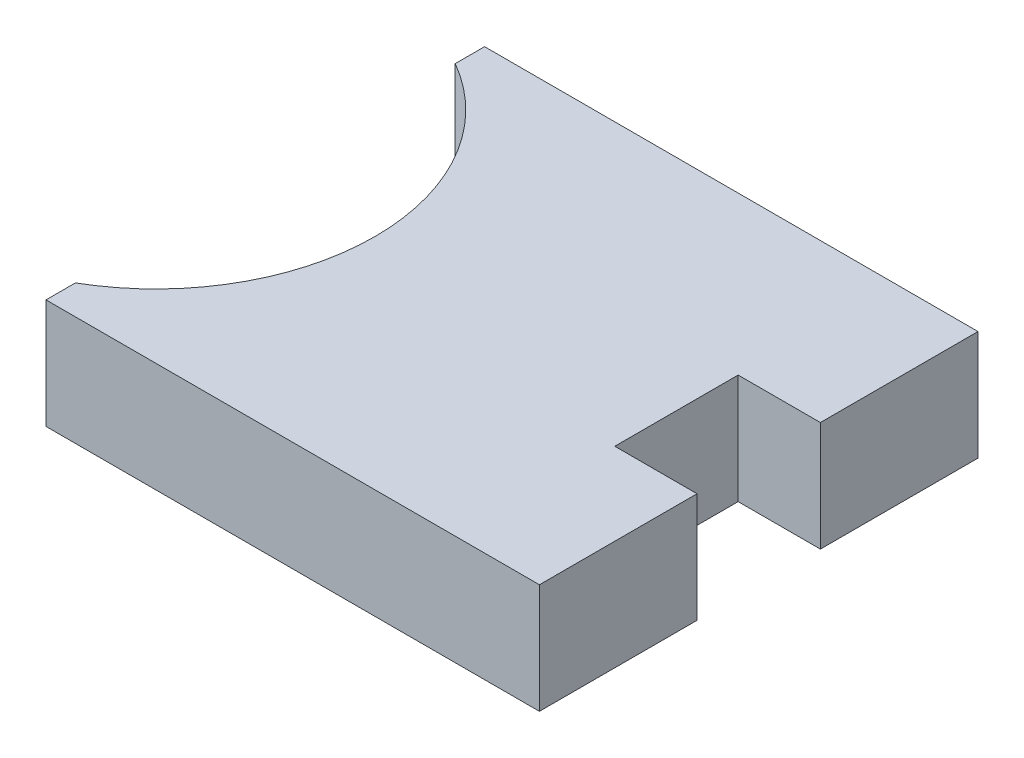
ISO-10303-21;
HEADER;
FILE_DESCRIPTION(('STEP AP214'),'2;1');
FILE_NAME('part.step','',(''),(''),'','','');
FILE_SCHEMA(('AUTOMOTIVE_DESIGN { 1 0 10303 214 1 1 1 1 }'));
ENDSEC;
DATA;
#1=APPLICATION_CONTEXT('core data for automotive mechanical design processes');
#2=APPLICATION_PROTOCOL_DEFINITION('international standard','automotive_design',2000,#1);
#3=PRODUCT_CONTEXT('',#1,'mechanical');
#4=PRODUCT('Part','Part','',(#3));
#5=PRODUCT_RELATED_PRODUCT_CATEGORY('part','',(#4));
#6=PRODUCT_DEFINITION_FORMATION('','',#4);
#7=PRODUCT_DEFINITION_CONTEXT('part definition',#1,'design');
#8=PRODUCT_DEFINITION('design','',#6,#7);
#9=PRODUCT_DEFINITION_SHAPE('','',#8);
#10=(LENGTH_UNIT() NAMED_UNIT(*) SI_UNIT(.MILLI.,.METRE.));
#11=(NAMED_UNIT(*) PLANE_ANGLE_UNIT() SI_UNIT($,.RADIAN.));
#12=(NAMED_UNIT(*) SI_UNIT($,.STERADIAN.) SOLID_ANGLE_UNIT());
#13=UNCERTAINTY_MEASURE_WITH_UNIT(LENGTH_MEASURE(1.E-05),#10,'distance_accuracy_value','');
#14=(GEOMETRIC_REPRESENTATION_CONTEXT(3) GLOBAL_UNCERTAINTY_ASSIGNED_CONTEXT((#13)) GLOBAL_UNIT_ASSIGNED_CONTEXT((#10,
#11,#12)) REPRESENTATION_CONTEXT('',''));
#15=CARTESIAN_POINT('',(0.,0.,0.));
#16=DIRECTION('',(0.,0.,1.));
#17=DIRECTION('',(1.,0.,0.));
#18=AXIS2_PLACEMENT_3D('',#15,#16,#17);
#19=CARTESIAN_POINT('',(46.5,6.75,-13.1782032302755));
#20=DIRECTION('',(-1.,0.,0.));
#21=DIRECTION('',(0.,0.,-1.));
#22=AXIS2_PLACEMENT_3D('',#19,#20,#21);
#23=PLANE('',#22);
#24=DIRECTION('',(0.,1.,0.));
#25=VECTOR('',#24,1.);
#26=CARTESIAN_POINT('',(46.5,4.74999999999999,-14.25));
#27=LINE('',#26,#25);
#28=CARTESIAN_POINT('',(46.5,2.74999999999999,-14.2500000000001));
#29=VERTEX_POINT('',#28);
#30=CARTESIAN_POINT('',(46.5,6.74999999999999,-14.2500000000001));
#31=VERTEX_POINT('',#30);
#32=EDGE_CURVE('E102',#29,#31,#27,.T.);
#33=ORIENTED_EDGE('',*,*,#32,.F.);
#34=DIRECTION('',(0.,0.,-1.));
#35=VECTOR('',#34,1.);
#36=CARTESIAN_POINT('',(46.5,2.75,-6.25000000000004));
#37=LINE('',#36,#35);
#38=CARTESIAN_POINT('',(46.5,2.74999999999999,-13.1782032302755));
#39=VERTEX_POINT('',#38);
#40=EDGE_CURVE('E97',#39,#29,#37,.T.);
#41=ORIENTED_EDGE('',*,*,#40,.F.);
#42=DIRECTION('',(0.,1.,0.));
#43=VECTOR('',#42,1.);
#44=CARTESIAN_POINT('',(46.5,4.75,-13.1782032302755));
#45=LINE('',#44,#43);
#46=CARTESIAN_POINT('',(46.5,6.74999999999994,-13.1782032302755));
#47=VERTEX_POINT('',#46);
#48=EDGE_CURVE('E99',#39,#47,#45,.T.);
#49=ORIENTED_EDGE('',*,*,#48,.T.);
#50=DIRECTION('',(0.,0.,-1.));
#51=VECTOR('',#50,1.);
#52=CARTESIAN_POINT('',(46.5,6.75,-13.7141016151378));
#53=LINE('',#52,#51);
#54=EDGE_CURVE('E134',#47,#31,#53,.T.);
#55=ORIENTED_EDGE('',*,*,#54,.T.);
#56=EDGE_LOOP('',(#33,#41,#49,#55));
#57=FACE_BOUND('',#56,.T.);
#58=ADVANCED_FACE('F16',(#57),#23,.T.);
#59=CARTESIAN_POINT('',(46.5,6.75000000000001,1.74999999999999));
#60=DIRECTION('',(-1.,0.,0.));
#61=DIRECTION('',(0.,0.,-1.));
#62=AXIS2_PLACEMENT_3D('',#59,#60,#61);
#63=PLANE('',#62);
#64=DIRECTION('',(0.,-1.,0.));
#65=VECTOR('',#64,1.);
#66=CARTESIAN_POINT('',(46.5,4.74999999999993,1.74999999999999));
#67=LINE('',#66,#65);
#68=CARTESIAN_POINT('',(46.5,6.74999999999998,1.74999999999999));
#69=VERTEX_POINT('',#68);
#70=CARTESIAN_POINT('',(46.5,2.75,1.74999999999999));
#71=VERTEX_POINT('',#70);
#72=EDGE_CURVE('E117',#69,#71,#67,.T.);
#73=ORIENTED_EDGE('',*,*,#72,.F.);
#74=DIRECTION('',(0.,0.,-1.));
#75=VECTOR('',#74,1.);
#76=CARTESIAN_POINT('',(46.5,6.75000000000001,1.21410161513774));
#77=LINE('',#76,#75);
#78=CARTESIAN_POINT('',(46.5,6.74999999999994,0.6782032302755));
#79=VERTEX_POINT('',#78);
#80=EDGE_CURVE('E132',#69,#79,#77,.T.);
#81=ORIENTED_EDGE('',*,*,#80,.T.);
#82=DIRECTION('',(0.,-1.,0.));
#83=VECTOR('',#82,1.);
#84=CARTESIAN_POINT('',(46.5,4.75,0.6782032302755));
#85=LINE('',#84,#83);
#86=CARTESIAN_POINT('',(46.5,2.75,0.678203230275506));
#87=VERTEX_POINT('',#86);
#88=EDGE_CURVE('E115',#79,#87,#85,.T.);
#89=ORIENTED_EDGE('',*,*,#88,.T.);
#90=DIRECTION('',(0.,0.,-1.));
#91=VECTOR('',#90,1.);
#92=CARTESIAN_POINT('',(46.5,2.75,-6.25000000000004));
#93=LINE('',#92,#91);
#94=EDGE_CURVE('E91',#71,#87,#93,.T.);
#95=ORIENTED_EDGE('',*,*,#94,.F.);
#96=EDGE_LOOP('',(#73,#81,#89,#95));
#97=FACE_BOUND('',#96,.T.);
#98=ADVANCED_FACE('F219',(#97),#63,.T.);
#99=CARTESIAN_POINT('',(46.5,2.75,1.74999999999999));
#100=DIRECTION('',(0.,-1.,0.));
#101=DIRECTION('',(0.,0.,-1.));
#102=AXIS2_PLACEMENT_3D('',#99,#100,#101);
#103=PLANE('',#102);
#104=DIRECTION('',(-1.,0.,0.));
#105=VECTOR('',#104,1.);
#106=CARTESIAN_POINT('',(55.5,2.74999999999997,-14.25));
#107=LINE('',#106,#105);
#108=CARTESIAN_POINT('',(64.5,2.74999999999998,-14.2500000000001));
#109=VERTEX_POINT('',#108);
#110=EDGE_CURVE('E111',#109,#29,#107,.T.);
#111=ORIENTED_EDGE('',*,*,#110,.F.);
#112=DIRECTION('',(0.,0.,1.));
#113=VECTOR('',#112,1.);
#114=CARTESIAN_POINT('',(64.5,2.74999999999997,-11.375));
#115=LINE('',#114,#113);
#116=CARTESIAN_POINT('',(64.5000000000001,2.75,-8.50000000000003));
#117=VERTEX_POINT('',#116);
#118=EDGE_CURVE('E128',#109,#117,#115,.T.);
#119=ORIENTED_EDGE('',*,*,#118,.T.);
#120=DIRECTION('',(-1.,0.,0.));
#121=VECTOR('',#120,1.);
#122=CARTESIAN_POINT('',(63.,2.75,-8.50000000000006));
#123=LINE('',#122,#121);
#124=CARTESIAN_POINT('',(61.5,2.74999999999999,-8.50000000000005));
#125=VERTEX_POINT('',#124);
#126=EDGE_CURVE('E105',#117,#125,#123,.T.);
#127=ORIENTED_EDGE('',*,*,#126,.T.);
#128=DIRECTION('',(0.,0.,1.));
#129=VECTOR('',#128,1.);
#130=CARTESIAN_POINT('',(61.5,2.74999999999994,-6.25000000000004));
#131=LINE('',#130,#129);
#132=CARTESIAN_POINT('',(61.5,2.74999999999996,-4.00000000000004));
#133=VERTEX_POINT('',#132);
#134=EDGE_CURVE('E172',#125,#133,#131,.T.);
#135=ORIENTED_EDGE('',*,*,#134,.T.);
#136=DIRECTION('',(1.,0.,0.));
#137=VECTOR('',#136,1.);
#138=CARTESIAN_POINT('',(63.,2.74999999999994,-4.00000000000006));
#139=LINE('',#138,#137);
#140=CARTESIAN_POINT('',(64.5,2.74999999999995,-4.00000000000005));
#141=VERTEX_POINT('',#140);
#142=EDGE_CURVE('E179',#133,#141,#139,.T.);
#143=ORIENTED_EDGE('',*,*,#142,.T.);
#144=DIRECTION('',(0.,0.,1.));
#145=VECTOR('',#144,1.);
#146=CARTESIAN_POINT('',(64.5,2.74999999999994,-1.12500000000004));
#147=LINE('',#146,#145);
#148=CARTESIAN_POINT('',(64.5,2.74999999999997,1.74999999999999));
#149=VERTEX_POINT('',#148);
#150=EDGE_CURVE('E120',#141,#149,#147,.T.);
#151=ORIENTED_EDGE('',*,*,#150,.T.);
#152=DIRECTION('',(1.,0.,0.));
#153=VECTOR('',#152,1.);
#154=CARTESIAN_POINT('',(55.5,2.74999999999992,1.74999999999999));
#155=LINE('',#154,#153);
#156=EDGE_CURVE('E138',#71,#149,#155,.T.);
#157=ORIENTED_EDGE('',*,*,#156,.F.);
#158=ORIENTED_EDGE('',*,*,#94,.T.);
#159=CARTESIAN_POINT('',(42.5,2.74999999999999,-6.25));
#160=DIRECTION('',(0.,-1.,0.));
#161=DIRECTION('',(1.,0.,0.));
#162=AXIS2_PLACEMENT_3D('',#159,#160,#161);
#163=CIRCLE('',#162,8.);
#164=EDGE_CURVE('E20',#87,#39,#163,.F.);
#165=ORIENTED_EDGE('',*,*,#164,.T.);
#166=ORIENTED_EDGE('',*,*,#40,.T.);
#167=EDGE_LOOP('',(#111,#119,#127,#135,#143,#151,#157,#158,#165,#166));
#168=FACE_BOUND('',#167,.T.);
#169=ADVANCED_FACE('F108',(#168),#103,.T.);
#170=CARTESIAN_POINT('',(61.5,6.75,-8.50000000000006));
#171=DIRECTION('',(0.,0.,-1.));
#172=DIRECTION('',(1.,0.,0.));
#173=AXIS2_PLACEMENT_3D('',#170,#171,#172);
#174=PLANE('',#173);
#175=DIRECTION('',(0.,1.,0.));
#176=VECTOR('',#175,1.);
#177=CARTESIAN_POINT('',(64.5,4.74999999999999,-8.50000000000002));
#178=LINE('',#177,#176);
#179=CARTESIAN_POINT('',(64.5000000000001,6.74999999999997,-8.50000000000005));
#180=VERTEX_POINT('',#179);
#181=EDGE_CURVE('E126',#117,#180,#178,.T.);
#182=ORIENTED_EDGE('',*,*,#181,.T.);
#183=DIRECTION('',(1.,0.,0.));
#184=VECTOR('',#183,1.);
#185=CARTESIAN_POINT('',(55.5,6.74999999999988,-8.50000000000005));
#186=LINE('',#185,#184);
#187=CARTESIAN_POINT('',(61.5,6.74999999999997,-8.50000000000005));
#188=VERTEX_POINT('',#187);
#189=EDGE_CURVE('E170',#188,#180,#186,.T.);
#190=ORIENTED_EDGE('',*,*,#189,.F.);
#191=DIRECTION('',(0.,-1.,0.));
#192=VECTOR('',#191,1.);
#193=CARTESIAN_POINT('',(61.5,4.74999999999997,-8.50000000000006));
#194=LINE('',#193,#192);
#195=EDGE_CURVE('E166',#188,#125,#194,.T.);
#196=ORIENTED_EDGE('',*,*,#195,.T.);
#197=ORIENTED_EDGE('',*,*,#126,.F.);
#198=EDGE_LOOP('',(#182,#190,#196,#197));
#199=FACE_BOUND('',#198,.T.);
#200=ADVANCED_FACE('F163',(#199),#174,.F.);
#201=CARTESIAN_POINT('',(64.5,6.75000000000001,-8.50000000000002));
#202=DIRECTION('',(-1.,0.,0.));
#203=DIRECTION('',(0.,0.,-1.));
#204=AXIS2_PLACEMENT_3D('',#201,#202,#203);
#205=PLANE('',#204);
#206=ORIENTED_EDGE('',*,*,#118,.F.);
#207=DIRECTION('',(0.,-1.,0.));
#208=VECTOR('',#207,1.);
#209=CARTESIAN_POINT('',(64.5,4.74999999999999,-14.25));
#210=LINE('',#209,#208);
#211=CARTESIAN_POINT('',(64.5,6.74999999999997,-14.25));
#212=VERTEX_POINT('',#211);
#213=EDGE_CURVE('E123',#212,#109,#210,.T.);
#214=ORIENTED_EDGE('',*,*,#213,.F.);
#215=DIRECTION('',(0.,0.,-1.));
#216=VECTOR('',#215,1.);
#217=CARTESIAN_POINT('',(64.5,6.74999999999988,-6.25000000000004));
#218=LINE('',#217,#216);
#219=EDGE_CURVE('E149',#180,#212,#218,.T.);
#220=ORIENTED_EDGE('',*,*,#219,.F.);
#221=ORIENTED_EDGE('',*,*,#181,.F.);
#222=EDGE_LOOP('',(#206,#214,#220,#221));
#223=FACE_BOUND('',#222,.T.);
#224=ADVANCED_FACE('F168',(#223),#205,.F.);
#225=CARTESIAN_POINT('',(46.5,6.75,-14.25));
#226=DIRECTION('',(0.,0.,-1.));
#227=DIRECTION('',(1.,0.,0.));
#228=AXIS2_PLACEMENT_3D('',#225,#226,#227);
#229=PLANE('',#228);
#230=ORIENTED_EDGE('',*,*,#213,.T.);
#231=ORIENTED_EDGE('',*,*,#110,.T.);
#232=ORIENTED_EDGE('',*,*,#32,.T.);
#233=DIRECTION('',(-1.,0.,0.));
#234=VECTOR('',#233,1.);
#235=CARTESIAN_POINT('',(55.5,6.74999999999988,-14.2500000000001));
#236=LINE('',#235,#234);
#237=EDGE_CURVE('E147',#212,#31,#236,.T.);
#238=ORIENTED_EDGE('',*,*,#237,.F.);
#239=EDGE_LOOP('',(#230,#231,#232,#238));
#240=FACE_BOUND('',#239,.T.);
#241=ADVANCED_FACE('F156',(#240),#229,.T.);
#242=CARTESIAN_POINT('',(42.5,6.75000000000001,-6.25));
#243=DIRECTION('',(0.,-1.,0.));
#244=DIRECTION('',(1.,0.,0.));
#245=AXIS2_PLACEMENT_3D('',#242,#243,#244);
#246=CYLINDRICAL_SURFACE('',#245,8.);
#247=CARTESIAN_POINT('',(42.5,6.74999999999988,-6.25));
#248=DIRECTION('',(0.,-1.,0.));
#249=DIRECTION('',(1.,0.,0.));
#250=AXIS2_PLACEMENT_3D('',#247,#248,#249);
#251=CIRCLE('',#250,8.);
#252=EDGE_CURVE('E114',#47,#79,#251,.T.);
#253=ORIENTED_EDGE('',*,*,#252,.F.);
#254=ORIENTED_EDGE('',*,*,#48,.F.);
#255=ORIENTED_EDGE('',*,*,#164,.F.);
#256=ORIENTED_EDGE('',*,*,#88,.F.);
#257=EDGE_LOOP('',(#253,#254,#255,#256));
#258=FACE_BOUND('',#257,.T.);
#259=ADVANCED_FACE('F112',(#258),#246,.F.);
#260=CARTESIAN_POINT('',(64.5,6.74999999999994,1.74999999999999));
#261=DIRECTION('',(0.,0.,1.));
#262=DIRECTION('',(-1.,0.,0.));
#263=AXIS2_PLACEMENT_3D('',#260,#261,#262);
#264=PLANE('',#263);
#265=DIRECTION('',(0.,1.,0.));
#266=VECTOR('',#265,1.);
#267=CARTESIAN_POINT('',(64.5,4.74999999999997,1.74999999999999));
#268=LINE('',#267,#266);
#269=CARTESIAN_POINT('',(64.5,6.74999999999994,1.74999999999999));
#270=VERTEX_POINT('',#269);
#271=EDGE_CURVE('E183',#149,#270,#268,.T.);
#272=ORIENTED_EDGE('',*,*,#271,.T.);
#273=DIRECTION('',(1.,0.,0.));
#274=VECTOR('',#273,1.);
#275=CARTESIAN_POINT('',(55.5,6.74999999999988,1.74999999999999));
#276=LINE('',#275,#274);
#277=EDGE_CURVE('E143',#69,#270,#276,.T.);
#278=ORIENTED_EDGE('',*,*,#277,.F.);
#279=ORIENTED_EDGE('',*,*,#72,.T.);
#280=ORIENTED_EDGE('',*,*,#156,.T.);
#281=EDGE_LOOP('',(#272,#278,#279,#280));
#282=FACE_BOUND('',#281,.T.);
#283=ADVANCED_FACE('F190',(#282),#264,.T.);
#284=CARTESIAN_POINT('',(64.5,6.75000000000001,1.74999999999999));
#285=DIRECTION('',(-1.,0.,0.));
#286=DIRECTION('',(0.,0.,-1.));
#287=AXIS2_PLACEMENT_3D('',#284,#285,#286);
#288=PLANE('',#287);
#289=DIRECTION('',(0.,0.,-1.));
#290=VECTOR('',#289,1.);
#291=CARTESIAN_POINT('',(64.5,6.74999999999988,-6.25000000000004));
#292=LINE('',#291,#290);
#293=CARTESIAN_POINT('',(64.5,6.74999999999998,-4.00000000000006));
#294=VERTEX_POINT('',#293);
#295=EDGE_CURVE('E146',#270,#294,#292,.T.);
#296=ORIENTED_EDGE('',*,*,#295,.F.);
#297=ORIENTED_EDGE('',*,*,#271,.F.);
#298=ORIENTED_EDGE('',*,*,#150,.F.);
#299=DIRECTION('',(0.,1.,0.));
#300=VECTOR('',#299,1.);
#301=CARTESIAN_POINT('',(64.5,4.74999999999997,-4.00000000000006));
#302=LINE('',#301,#300);
#303=EDGE_CURVE('E182',#141,#294,#302,.T.);
#304=ORIENTED_EDGE('',*,*,#303,.T.);
#305=EDGE_LOOP('',(#296,#297,#298,#304));
#306=FACE_BOUND('',#305,.T.);
#307=ADVANCED_FACE('F191',(#306),#288,.F.);
#308=CARTESIAN_POINT('',(64.5,6.75,-4.00000000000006));
#309=DIRECTION('',(0.,0.,1.));
#310=DIRECTION('',(-1.,0.,0.));
#311=AXIS2_PLACEMENT_3D('',#308,#309,#310);
#312=PLANE('',#311);
#313=DIRECTION('',(0.,1.,0.));
#314=VECTOR('',#313,1.);
#315=CARTESIAN_POINT('',(61.5,4.74999999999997,-4.00000000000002));
#316=LINE('',#315,#314);
#317=CARTESIAN_POINT('',(61.5,6.74999999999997,-4.00000000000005));
#318=VERTEX_POINT('',#317);
#319=EDGE_CURVE('E35',#133,#318,#316,.T.);
#320=ORIENTED_EDGE('',*,*,#319,.T.);
#321=DIRECTION('',(-1.,0.,0.));
#322=VECTOR('',#321,1.);
#323=CARTESIAN_POINT('',(55.5,6.74999999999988,-4.00000000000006));
#324=LINE('',#323,#322);
#325=EDGE_CURVE('E26',#294,#318,#324,.T.);
#326=ORIENTED_EDGE('',*,*,#325,.F.);
#327=ORIENTED_EDGE('',*,*,#303,.F.);
#328=ORIENTED_EDGE('',*,*,#142,.F.);
#329=EDGE_LOOP('',(#320,#326,#327,#328));
#330=FACE_BOUND('',#329,.T.);
#331=ADVANCED_FACE('F194',(#330),#312,.F.);
#332=CARTESIAN_POINT('',(61.5,6.75,-4.00000000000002));
#333=DIRECTION('',(-1.,0.,0.));
#334=DIRECTION('',(0.,0.,-1.));
#335=AXIS2_PLACEMENT_3D('',#332,#333,#334);
#336=PLANE('',#335);
#337=ORIENTED_EDGE('',*,*,#195,.F.);
#338=DIRECTION('',(0.,0.,-1.));
#339=VECTOR('',#338,1.);
#340=CARTESIAN_POINT('',(61.5,6.74999999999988,-6.25000000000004));
#341=LINE('',#340,#339);
#342=EDGE_CURVE('E11',#318,#188,#341,.T.);
#343=ORIENTED_EDGE('',*,*,#342,.F.);
#344=ORIENTED_EDGE('',*,*,#319,.F.);
#345=ORIENTED_EDGE('',*,*,#134,.F.);
#346=EDGE_LOOP('',(#337,#343,#344,#345));
#347=FACE_BOUND('',#346,.T.);
#348=ADVANCED_FACE('F196',(#347),#336,.F.);
#349=CARTESIAN_POINT('',(46.5,6.74999999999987,-14.2500000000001));
#350=DIRECTION('',(0.,1.,0.));
#351=DIRECTION('',(0.,0.,1.));
#352=AXIS2_PLACEMENT_3D('',#349,#350,#351);
#353=PLANE('',#352);
#354=ORIENTED_EDGE('',*,*,#325,.T.);
#355=ORIENTED_EDGE('',*,*,#342,.T.);
#356=ORIENTED_EDGE('',*,*,#189,.T.);
#357=ORIENTED_EDGE('',*,*,#219,.T.);
#358=ORIENTED_EDGE('',*,*,#237,.T.);
#359=ORIENTED_EDGE('',*,*,#54,.F.);
#360=ORIENTED_EDGE('',*,*,#252,.T.);
#361=ORIENTED_EDGE('',*,*,#80,.F.);
#362=ORIENTED_EDGE('',*,*,#277,.T.);
#363=ORIENTED_EDGE('',*,*,#295,.T.);
#364=EDGE_LOOP('',(#354,#355,#356,#357,#358,#359,#360,#361,#362,#363));
#365=FACE_BOUND('',#364,.T.);
#366=ADVANCED_FACE('F18',(#365),#353,.T.);
#367=CLOSED_SHELL('',(#58,#98,#169,#200,#224,#241,#259,#283,#307,#331,#348,#366));
#368=MANIFOLD_SOLID_BREP('B1',#367);
#369=ADVANCED_BREP_SHAPE_REPRESENTATION('',(#18,#368),#14);
#370=SHAPE_DEFINITION_REPRESENTATION(#9,#369);
ENDSEC;
END-ISO-10303-21;
